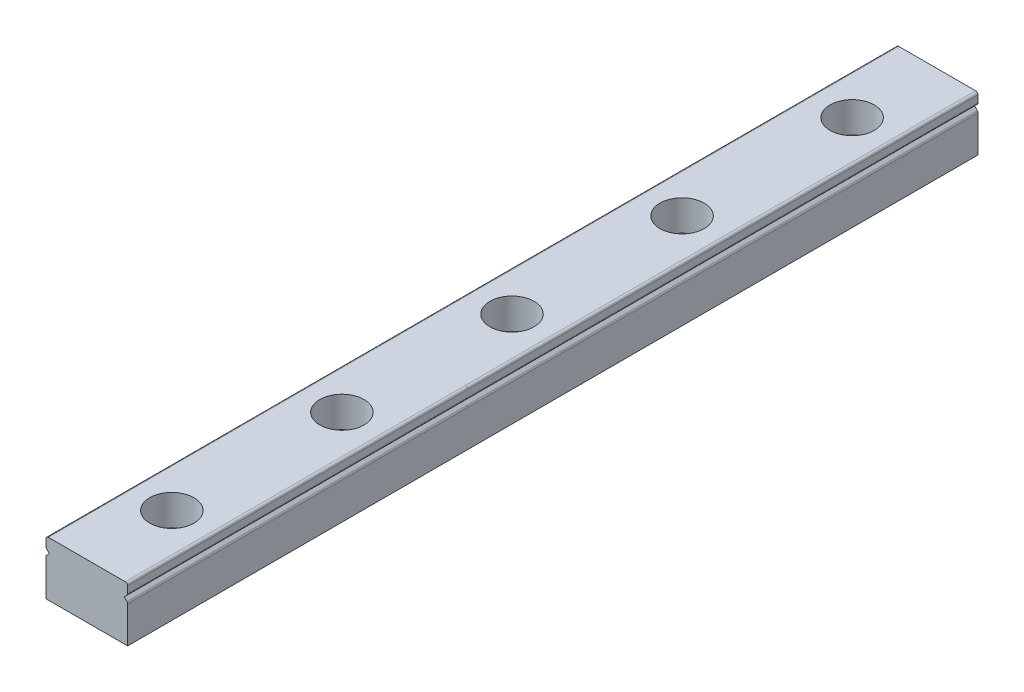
ISO-10303-21;
HEADER;
FILE_DESCRIPTION(('STEP AP214'),'2;1');
FILE_NAME('part.step','',(''),(''),'','','');
FILE_SCHEMA(('AUTOMOTIVE_DESIGN { 1 0 10303 214 1 1 1 1 }'));
ENDSEC;
DATA;
#1=APPLICATION_CONTEXT('core data for automotive mechanical design processes');
#2=APPLICATION_PROTOCOL_DEFINITION('international standard','automotive_design',2000,#1);
#3=PRODUCT_CONTEXT('',#1,'mechanical');
#4=PRODUCT('Part','Part','',(#3));
#5=PRODUCT_RELATED_PRODUCT_CATEGORY('part','',(#4));
#6=PRODUCT_DEFINITION_FORMATION('','',#4);
#7=PRODUCT_DEFINITION_CONTEXT('part definition',#1,'design');
#8=PRODUCT_DEFINITION('design','',#6,#7);
#9=PRODUCT_DEFINITION_SHAPE('','',#8);
#10=(LENGTH_UNIT() NAMED_UNIT(*) SI_UNIT(.MILLI.,.METRE.));
#11=(NAMED_UNIT(*) PLANE_ANGLE_UNIT() SI_UNIT($,.RADIAN.));
#12=(NAMED_UNIT(*) SI_UNIT($,.STERADIAN.) SOLID_ANGLE_UNIT());
#13=UNCERTAINTY_MEASURE_WITH_UNIT(LENGTH_MEASURE(1.E-05),#10,'distance_accuracy_value','');
#14=(GEOMETRIC_REPRESENTATION_CONTEXT(3) GLOBAL_UNCERTAINTY_ASSIGNED_CONTEXT((#13)) GLOBAL_UNIT_ASSIGNED_CONTEXT((#10,
#11,#12)) REPRESENTATION_CONTEXT('',''));
#15=CARTESIAN_POINT('',(0.,0.,0.));
#16=DIRECTION('',(0.,0.,1.));
#17=DIRECTION('',(1.,0.,0.));
#18=AXIS2_PLACEMENT_3D('',#15,#16,#17);
#19=CARTESIAN_POINT('',(0.,0.,75.));
#20=DIRECTION('',(0.,1.,0.));
#21=DIRECTION('',(0.,0.,1.));
#22=AXIS2_PLACEMENT_3D('',#19,#20,#21);
#23=PLANE('',#22);
#24=CARTESIAN_POINT('',(0.,0.,12.5));
#25=DIRECTION('',(0.,1.,0.));
#26=DIRECTION('',(0.,0.,1.));
#27=AXIS2_PLACEMENT_3D('',#24,#25,#26);
#28=CIRCLE('',#27,1.75);
#29=CARTESIAN_POINT('',(0.,0.,14.25));
#30=VERTEX_POINT('',#29);
#31=EDGE_CURVE('E449',#30,#30,#28,.T.);
#32=ORIENTED_EDGE('',*,*,#31,.T.);
#33=EDGE_LOOP('',(#32));
#34=FACE_BOUND('',#33,.T.);
#35=CARTESIAN_POINT('',(0.,0.,37.5));
#36=DIRECTION('',(0.,1.,0.));
#37=DIRECTION('',(0.,0.,1.));
#38=AXIS2_PLACEMENT_3D('',#35,#36,#37);
#39=CIRCLE('',#38,1.75);
#40=CARTESIAN_POINT('',(0.,0.,39.25));
#41=VERTEX_POINT('',#40);
#42=EDGE_CURVE('E437',#41,#41,#39,.T.);
#43=ORIENTED_EDGE('',*,*,#42,.T.);
#44=EDGE_LOOP('',(#43));
#45=FACE_BOUND('',#44,.T.);
#46=CARTESIAN_POINT('',(0.,0.,-12.5));
#47=DIRECTION('',(0.,1.,0.));
#48=DIRECTION('',(0.,0.,1.));
#49=AXIS2_PLACEMENT_3D('',#46,#47,#48);
#50=CIRCLE('',#49,1.75);
#51=CARTESIAN_POINT('',(0.,0.,-10.75));
#52=VERTEX_POINT('',#51);
#53=EDGE_CURVE('E407',#52,#52,#50,.T.);
#54=ORIENTED_EDGE('',*,*,#53,.T.);
#55=EDGE_LOOP('',(#54));
#56=FACE_BOUND('',#55,.T.);
#57=CARTESIAN_POINT('',(0.,0.,-37.5));
#58=DIRECTION('',(0.,1.,0.));
#59=DIRECTION('',(0.,0.,1.));
#60=AXIS2_PLACEMENT_3D('',#57,#58,#59);
#61=CIRCLE('',#60,1.75);
#62=CARTESIAN_POINT('',(0.,0.,-35.75));
#63=VERTEX_POINT('',#62);
#64=EDGE_CURVE('E395',#63,#63,#61,.T.);
#65=ORIENTED_EDGE('',*,*,#64,.T.);
#66=EDGE_LOOP('',(#65));
#67=FACE_BOUND('',#66,.T.);
#68=CARTESIAN_POINT('',(0.,0.,-62.5));
#69=DIRECTION('',(0.,1.,0.));
#70=DIRECTION('',(0.,0.,1.));
#71=AXIS2_PLACEMENT_3D('',#68,#69,#70);
#72=CIRCLE('',#71,1.75);
#73=CARTESIAN_POINT('',(0.,0.,-60.75));
#74=VERTEX_POINT('',#73);
#75=EDGE_CURVE('E203',#74,#74,#72,.T.);
#76=ORIENTED_EDGE('',*,*,#75,.T.);
#77=EDGE_LOOP('',(#76));
#78=FACE_BOUND('',#77,.T.);
#79=DIRECTION('',(-1.,0.,0.));
#80=VECTOR('',#79,1.);
#81=CARTESIAN_POINT('',(-20.7186141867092,0.,50.));
#82=LINE('',#81,#80);
#83=CARTESIAN_POINT('',(6.,0.,50.));
#84=VERTEX_POINT('',#83);
#85=CARTESIAN_POINT('',(-6.,0.,50.));
#86=VERTEX_POINT('',#85);
#87=EDGE_CURVE('E183',#84,#86,#82,.T.);
#88=ORIENTED_EDGE('',*,*,#87,.T.);
#89=DIRECTION('',(0.,0.,-1.));
#90=VECTOR('',#89,1.);
#91=CARTESIAN_POINT('',(-6.,0.,75.));
#92=LINE('',#91,#90);
#93=CARTESIAN_POINT('',(-6.,0.,-75.));
#94=VERTEX_POINT('',#93);
#95=EDGE_CURVE('E353',#86,#94,#92,.T.);
#96=ORIENTED_EDGE('',*,*,#95,.T.);
#97=DIRECTION('',(1.,0.,0.));
#98=VECTOR('',#97,1.);
#99=CARTESIAN_POINT('',(0.,0.,-75.));
#100=LINE('',#99,#98);
#101=CARTESIAN_POINT('',(6.,0.,-75.));
#102=VERTEX_POINT('',#101);
#103=EDGE_CURVE('E208',#94,#102,#100,.T.);
#104=ORIENTED_EDGE('',*,*,#103,.T.);
#105=DIRECTION('',(0.,0.,-1.));
#106=VECTOR('',#105,1.);
#107=CARTESIAN_POINT('',(6.,0.,75.));
#108=LINE('',#107,#106);
#109=EDGE_CURVE('E198',#84,#102,#108,.T.);
#110=ORIENTED_EDGE('',*,*,#109,.F.);
#111=EDGE_LOOP('',(#88,#96,#104,#110));
#112=FACE_BOUND('',#111,.T.);
#113=ADVANCED_FACE('F34',(#34,#45,#56,#67,#78,#112),#23,.F.);
#114=CARTESIAN_POINT('',(6.,0.,75.));
#115=DIRECTION('',(-1.,0.,0.));
#116=DIRECTION('',(0.,-1.,0.));
#117=AXIS2_PLACEMENT_3D('',#114,#115,#116);
#118=PLANE('',#117);
#119=DIRECTION('',(0.,1.,0.));
#120=VECTOR('',#119,1.);
#121=CARTESIAN_POINT('',(6.,0.,50.));
#122=LINE('',#121,#120);
#123=CARTESIAN_POINT('',(6.,5.35502525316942,50.));
#124=VERTEX_POINT('',#123);
#125=EDGE_CURVE('E186',#84,#124,#122,.T.);
#126=ORIENTED_EDGE('',*,*,#125,.F.);
#127=ORIENTED_EDGE('',*,*,#109,.T.);
#128=DIRECTION('',(0.,1.,0.));
#129=VECTOR('',#128,1.);
#130=CARTESIAN_POINT('',(6.,0.,-75.));
#131=LINE('',#130,#129);
#132=CARTESIAN_POINT('',(6.,5.35502525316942,-75.));
#133=VERTEX_POINT('',#132);
#134=EDGE_CURVE('E434',#102,#133,#131,.T.);
#135=ORIENTED_EDGE('',*,*,#134,.T.);
#136=DIRECTION('',(0.,0.,1.));
#137=VECTOR('',#136,1.);
#138=CARTESIAN_POINT('',(6.,5.35502525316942,75.));
#139=LINE('',#138,#137);
#140=CARTESIAN_POINT('',(6.,5.35502525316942,0.));
#141=VERTEX_POINT('',#140);
#142=EDGE_CURVE('E307',#133,#141,#139,.T.);
#143=ORIENTED_EDGE('',*,*,#142,.T.);
#144=DIRECTION('',(0.,0.,-1.));
#145=VECTOR('',#144,1.);
#146=CARTESIAN_POINT('',(6.,5.35502525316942,75.));
#147=LINE('',#146,#145);
#148=EDGE_CURVE('E202',#141,#124,#147,.F.);
#149=ORIENTED_EDGE('',*,*,#148,.T.);
#150=EDGE_LOOP('',(#126,#127,#135,#143,#149));
#151=FACE_BOUND('',#150,.T.);
#152=ADVANCED_FACE('F196',(#151),#118,.F.);
#153=CARTESIAN_POINT('',(5.5,6.,75.));
#154=DIRECTION('',(-0.707106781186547,-0.707106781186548,0.));
#155=DIRECTION('',(0.707106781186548,-0.707106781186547,0.));
#156=AXIS2_PLACEMENT_3D('',#153,#154,#155);
#157=PLANE('',#156);
#158=DIRECTION('',(-0.707106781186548,0.707106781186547,0.));
#159=VECTOR('',#158,1.);
#160=CARTESIAN_POINT('',(5.5,6.,50.));
#161=LINE('',#160,#159);
#162=CARTESIAN_POINT('',(5.89748737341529,5.60251262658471,50.));
#163=VERTEX_POINT('',#162);
#164=CARTESIAN_POINT('',(5.5,6.,50.));
#165=VERTEX_POINT('',#164);
#166=EDGE_CURVE('E381',#163,#165,#161,.T.);
#167=ORIENTED_EDGE('',*,*,#166,.F.);
#168=DIRECTION('',(0.,0.,-1.));
#169=VECTOR('',#168,1.);
#170=CARTESIAN_POINT('',(5.89748737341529,5.60251262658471,75.));
#171=LINE('',#170,#169);
#172=CARTESIAN_POINT('',(5.89748737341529,5.60251262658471,0.));
#173=VERTEX_POINT('',#172);
#174=EDGE_CURVE('E230',#163,#173,#171,.T.);
#175=ORIENTED_EDGE('',*,*,#174,.T.);
#176=DIRECTION('',(0.,0.,1.));
#177=VECTOR('',#176,1.);
#178=CARTESIAN_POINT('',(5.89748737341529,5.60251262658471,75.));
#179=LINE('',#178,#177);
#180=CARTESIAN_POINT('',(5.89748737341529,5.60251262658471,-75.));
#181=VERTEX_POINT('',#180);
#182=EDGE_CURVE('E311',#173,#181,#179,.F.);
#183=ORIENTED_EDGE('',*,*,#182,.T.);
#184=DIRECTION('',(-0.707106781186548,0.707106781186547,0.));
#185=VECTOR('',#184,1.);
#186=CARTESIAN_POINT('',(5.5,6.,-75.));
#187=LINE('',#186,#185);
#188=CARTESIAN_POINT('',(5.5,6.,-75.));
#189=VERTEX_POINT('',#188);
#190=EDGE_CURVE('E431',#181,#189,#187,.T.);
#191=ORIENTED_EDGE('',*,*,#190,.T.);
#192=DIRECTION('',(0.,0.,-1.));
#193=VECTOR('',#192,1.);
#194=CARTESIAN_POINT('',(5.5,6.,75.));
#195=LINE('',#194,#193);
#196=EDGE_CURVE('E209',#165,#189,#195,.T.);
#197=ORIENTED_EDGE('',*,*,#196,.F.);
#198=EDGE_LOOP('',(#167,#175,#183,#191,#197));
#199=FACE_BOUND('',#198,.T.);
#200=ADVANCED_FACE('F480',(#199),#157,.F.);
#201=CARTESIAN_POINT('',(6.,6.5,75.));
#202=DIRECTION('',(-0.707106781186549,0.707106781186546,0.));
#203=DIRECTION('',(-0.707106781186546,-0.707106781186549,0.));
#204=AXIS2_PLACEMENT_3D('',#201,#202,#203);
#205=PLANE('',#204);
#206=DIRECTION('',(0.707106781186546,0.707106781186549,0.));
#207=VECTOR('',#206,1.);
#208=CARTESIAN_POINT('',(6.,6.5,50.));
#209=LINE('',#208,#207);
#210=CARTESIAN_POINT('',(5.89748737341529,6.39748737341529,50.));
#211=VERTEX_POINT('',#210);
#212=EDGE_CURVE('E379',#165,#211,#209,.T.);
#213=ORIENTED_EDGE('',*,*,#212,.F.);
#214=ORIENTED_EDGE('',*,*,#196,.T.);
#215=DIRECTION('',(0.707106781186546,0.707106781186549,0.));
#216=VECTOR('',#215,1.);
#217=CARTESIAN_POINT('',(6.,6.5,-75.));
#218=LINE('',#217,#216);
#219=CARTESIAN_POINT('',(5.89748737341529,6.39748737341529,-75.));
#220=VERTEX_POINT('',#219);
#221=EDGE_CURVE('E428',#189,#220,#218,.T.);
#222=ORIENTED_EDGE('',*,*,#221,.T.);
#223=DIRECTION('',(0.,0.,1.));
#224=VECTOR('',#223,1.);
#225=CARTESIAN_POINT('',(5.89748737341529,6.39748737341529,75.));
#226=LINE('',#225,#224);
#227=CARTESIAN_POINT('',(5.89748737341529,6.39748737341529,0.));
#228=VERTEX_POINT('',#227);
#229=EDGE_CURVE('E305',#220,#228,#226,.T.);
#230=ORIENTED_EDGE('',*,*,#229,.T.);
#231=DIRECTION('',(0.,0.,-1.));
#232=VECTOR('',#231,1.);
#233=CARTESIAN_POINT('',(5.89748737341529,6.39748737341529,75.));
#234=LINE('',#233,#232);
#235=EDGE_CURVE('E231',#228,#211,#234,.F.);
#236=ORIENTED_EDGE('',*,*,#235,.T.);
#237=EDGE_LOOP('',(#213,#214,#222,#230,#236));
#238=FACE_BOUND('',#237,.T.);
#239=ADVANCED_FACE('F770',(#238),#205,.F.);
#240=CARTESIAN_POINT('',(6.,8.,75.));
#241=DIRECTION('',(-1.,0.,0.));
#242=DIRECTION('',(0.,0.,1.));
#243=AXIS2_PLACEMENT_3D('',#240,#241,#242);
#244=PLANE('',#243);
#245=DIRECTION('',(0.,1.,0.));
#246=VECTOR('',#245,1.);
#247=CARTESIAN_POINT('',(6.,8.,50.));
#248=LINE('',#247,#246);
#249=CARTESIAN_POINT('',(6.,6.64497474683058,50.));
#250=VERTEX_POINT('',#249);
#251=CARTESIAN_POINT('',(6.,7.65,50.));
#252=VERTEX_POINT('',#251);
#253=EDGE_CURVE('E374',#250,#252,#248,.T.);
#254=ORIENTED_EDGE('',*,*,#253,.F.);
#255=DIRECTION('',(0.,0.,-1.));
#256=VECTOR('',#255,1.);
#257=CARTESIAN_POINT('',(6.,6.64497474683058,75.));
#258=LINE('',#257,#256);
#259=CARTESIAN_POINT('',(6.,6.64497474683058,0.));
#260=VERTEX_POINT('',#259);
#261=EDGE_CURVE('E233',#250,#260,#258,.T.);
#262=ORIENTED_EDGE('',*,*,#261,.T.);
#263=DIRECTION('',(0.,0.,1.));
#264=VECTOR('',#263,1.);
#265=CARTESIAN_POINT('',(6.,6.64497474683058,75.));
#266=LINE('',#265,#264);
#267=CARTESIAN_POINT('',(6.,6.64497474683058,-75.));
#268=VERTEX_POINT('',#267);
#269=EDGE_CURVE('E279',#260,#268,#266,.F.);
#270=ORIENTED_EDGE('',*,*,#269,.T.);
#271=DIRECTION('',(0.,1.,0.));
#272=VECTOR('',#271,1.);
#273=CARTESIAN_POINT('',(6.,8.,-75.));
#274=LINE('',#273,#272);
#275=CARTESIAN_POINT('',(6.,7.65,-75.));
#276=VERTEX_POINT('',#275);
#277=EDGE_CURVE('E426',#268,#276,#274,.T.);
#278=ORIENTED_EDGE('',*,*,#277,.T.);
#279=DIRECTION('',(0.,0.,1.));
#280=VECTOR('',#279,1.);
#281=CARTESIAN_POINT('',(6.,7.65,75.));
#282=LINE('',#281,#280);
#283=CARTESIAN_POINT('',(6.,7.65,0.));
#284=VERTEX_POINT('',#283);
#285=EDGE_CURVE('E283',#276,#284,#282,.T.);
#286=ORIENTED_EDGE('',*,*,#285,.T.);
#287=DIRECTION('',(0.,0.,-1.));
#288=VECTOR('',#287,1.);
#289=CARTESIAN_POINT('',(6.,7.65,75.));
#290=LINE('',#289,#288);
#291=EDGE_CURVE('E235',#284,#252,#290,.F.);
#292=ORIENTED_EDGE('',*,*,#291,.T.);
#293=EDGE_LOOP('',(#254,#262,#270,#278,#286,#292));
#294=FACE_BOUND('',#293,.T.);
#295=ADVANCED_FACE('F514',(#294),#244,.F.);
#296=CARTESIAN_POINT('',(0.,8.,75.));
#297=DIRECTION('',(0.,-1.,0.));
#298=DIRECTION('',(0.,0.,-1.));
#299=AXIS2_PLACEMENT_3D('',#296,#297,#298);
#300=PLANE('',#299);
#301=CARTESIAN_POINT('',(0.,8.,12.5));
#302=DIRECTION('',(0.,1.,0.));
#303=DIRECTION('',(0.,0.,1.));
#304=AXIS2_PLACEMENT_3D('',#301,#302,#303);
#305=CIRCLE('',#304,3.25);
#306=CARTESIAN_POINT('',(0.,8.,15.75));
#307=VERTEX_POINT('',#306);
#308=EDGE_CURVE('E458',#307,#307,#305,.T.);
#309=ORIENTED_EDGE('',*,*,#308,.F.);
#310=EDGE_LOOP('',(#309));
#311=FACE_BOUND('',#310,.T.);
#312=CARTESIAN_POINT('',(0.,8.,37.5));
#313=DIRECTION('',(0.,1.,0.));
#314=DIRECTION('',(0.,0.,1.));
#315=AXIS2_PLACEMENT_3D('',#312,#313,#314);
#316=CIRCLE('',#315,3.25);
#317=CARTESIAN_POINT('',(0.,8.,40.75));
#318=VERTEX_POINT('',#317);
#319=EDGE_CURVE('E440',#318,#318,#316,.T.);
#320=ORIENTED_EDGE('',*,*,#319,.F.);
#321=EDGE_LOOP('',(#320));
#322=FACE_BOUND('',#321,.T.);
#323=CARTESIAN_POINT('',(0.,8.,-12.5));
#324=DIRECTION('',(0.,1.,0.));
#325=DIRECTION('',(0.,0.,1.));
#326=AXIS2_PLACEMENT_3D('',#323,#324,#325);
#327=CIRCLE('',#326,3.25);
#328=CARTESIAN_POINT('',(0.,8.,-9.25));
#329=VERTEX_POINT('',#328);
#330=EDGE_CURVE('E346',#329,#329,#327,.T.);
#331=ORIENTED_EDGE('',*,*,#330,.F.);
#332=EDGE_LOOP('',(#331));
#333=FACE_BOUND('',#332,.T.);
#334=CARTESIAN_POINT('',(0.,8.,-37.5));
#335=DIRECTION('',(0.,1.,0.));
#336=DIRECTION('',(0.,0.,1.));
#337=AXIS2_PLACEMENT_3D('',#334,#335,#336);
#338=CIRCLE('',#337,3.25);
#339=CARTESIAN_POINT('',(0.,8.,-34.25));
#340=VERTEX_POINT('',#339);
#341=EDGE_CURVE('E404',#340,#340,#338,.T.);
#342=ORIENTED_EDGE('',*,*,#341,.F.);
#343=EDGE_LOOP('',(#342));
#344=FACE_BOUND('',#343,.T.);
#345=CARTESIAN_POINT('',(0.,8.,-62.5));
#346=DIRECTION('',(0.,1.,0.));
#347=DIRECTION('',(0.,0.,1.));
#348=AXIS2_PLACEMENT_3D('',#345,#346,#347);
#349=CIRCLE('',#348,3.25);
#350=CARTESIAN_POINT('',(0.,8.,-59.25));
#351=VERTEX_POINT('',#350);
#352=EDGE_CURVE('E392',#351,#351,#349,.T.);
#353=ORIENTED_EDGE('',*,*,#352,.F.);
#354=EDGE_LOOP('',(#353));
#355=FACE_BOUND('',#354,.T.);
#356=DIRECTION('',(-1.,0.,0.));
#357=VECTOR('',#356,1.);
#358=CARTESIAN_POINT('',(0.,8.,50.));
#359=LINE('',#358,#357);
#360=CARTESIAN_POINT('',(5.65,8.,50.));
#361=VERTEX_POINT('',#360);
#362=CARTESIAN_POINT('',(-5.65,8.,50.));
#363=VERTEX_POINT('',#362);
#364=EDGE_CURVE('E369',#361,#363,#359,.T.);
#365=ORIENTED_EDGE('',*,*,#364,.F.);
#366=DIRECTION('',(0.,0.,-1.));
#367=VECTOR('',#366,1.);
#368=CARTESIAN_POINT('',(5.65,8.,75.));
#369=LINE('',#368,#367);
#370=CARTESIAN_POINT('',(5.65,8.,0.));
#371=VERTEX_POINT('',#370);
#372=EDGE_CURVE('E37',#361,#371,#369,.T.);
#373=ORIENTED_EDGE('',*,*,#372,.T.);
#374=DIRECTION('',(0.,0.,1.));
#375=VECTOR('',#374,1.);
#376=CARTESIAN_POINT('',(5.65,8.,75.));
#377=LINE('',#376,#375);
#378=CARTESIAN_POINT('',(5.65,8.,-75.));
#379=VERTEX_POINT('',#378);
#380=EDGE_CURVE('E288',#371,#379,#377,.F.);
#381=ORIENTED_EDGE('',*,*,#380,.T.);
#382=DIRECTION('',(-1.,0.,0.));
#383=VECTOR('',#382,1.);
#384=CARTESIAN_POINT('',(0.,8.,-75.));
#385=LINE('',#384,#383);
#386=CARTESIAN_POINT('',(-5.65,8.,-75.));
#387=VERTEX_POINT('',#386);
#388=EDGE_CURVE('E423',#379,#387,#385,.T.);
#389=ORIENTED_EDGE('',*,*,#388,.T.);
#390=DIRECTION('',(0.,0.,1.));
#391=VECTOR('',#390,1.);
#392=CARTESIAN_POINT('',(-5.65,8.,0.));
#393=LINE('',#392,#391);
#394=CARTESIAN_POINT('',(-5.65,8.,0.));
#395=VERTEX_POINT('',#394);
#396=EDGE_CURVE('E315',#387,#395,#393,.T.);
#397=ORIENTED_EDGE('',*,*,#396,.T.);
#398=DIRECTION('',(0.,0.,-1.));
#399=VECTOR('',#398,1.);
#400=CARTESIAN_POINT('',(-5.65,8.,75.));
#401=LINE('',#400,#399);
#402=EDGE_CURVE('E270',#395,#363,#401,.F.);
#403=ORIENTED_EDGE('',*,*,#402,.T.);
#404=EDGE_LOOP('',(#365,#373,#381,#389,#397,#403));
#405=FACE_BOUND('',#404,.T.);
#406=ADVANCED_FACE('F510',(#311,#322,#333,#344,#355,#405),#300,.F.);
#407=CARTESIAN_POINT('',(5.65,7.65,75.));
#408=DIRECTION('',(0.,0.,-1.));
#409=DIRECTION('',(-1.,0.,0.));
#410=AXIS2_PLACEMENT_3D('',#407,#408,#409);
#411=CYLINDRICAL_SURFACE('',#410,0.35);
#412=ORIENTED_EDGE('',*,*,#372,.F.);
#413=CARTESIAN_POINT('',(5.65,7.65,50.));
#414=DIRECTION('',(0.,0.,1.));
#415=DIRECTION('',(1.,0.,0.));
#416=AXIS2_PLACEMENT_3D('',#413,#414,#415);
#417=CIRCLE('',#416,0.35);
#418=EDGE_CURVE('E371',#361,#252,#417,.F.);
#419=ORIENTED_EDGE('',*,*,#418,.T.);
#420=ORIENTED_EDGE('',*,*,#291,.F.);
#421=CARTESIAN_POINT('',(5.65,7.65,0.));
#422=DIRECTION('',(0.,0.,1.));
#423=DIRECTION('',(1.,0.,0.));
#424=AXIS2_PLACEMENT_3D('',#421,#422,#423);
#425=CIRCLE('',#424,0.35);
#426=EDGE_CURVE('E236',#371,#284,#425,.F.);
#427=ORIENTED_EDGE('',*,*,#426,.F.);
#428=EDGE_LOOP('',(#412,#419,#420,#427));
#429=FACE_BOUND('',#428,.T.);
#430=ADVANCED_FACE('F513',(#429),#411,.T.);
#431=CARTESIAN_POINT('',(5.65,6.64497474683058,75.));
#432=DIRECTION('',(0.,0.,-1.));
#433=DIRECTION('',(-1.,0.,0.));
#434=AXIS2_PLACEMENT_3D('',#431,#432,#433);
#435=CYLINDRICAL_SURFACE('',#434,0.35);
#436=ORIENTED_EDGE('',*,*,#261,.F.);
#437=CARTESIAN_POINT('',(5.65,6.64497474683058,50.));
#438=DIRECTION('',(0.,0.,1.));
#439=DIRECTION('',(1.,0.,0.));
#440=AXIS2_PLACEMENT_3D('',#437,#438,#439);
#441=CIRCLE('',#440,0.35);
#442=EDGE_CURVE('E376',#250,#211,#441,.F.);
#443=ORIENTED_EDGE('',*,*,#442,.T.);
#444=ORIENTED_EDGE('',*,*,#235,.F.);
#445=CARTESIAN_POINT('',(5.65,6.64497474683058,0.));
#446=DIRECTION('',(0.,0.,1.));
#447=DIRECTION('',(1.,0.,0.));
#448=AXIS2_PLACEMENT_3D('',#445,#446,#447);
#449=CIRCLE('',#448,0.35);
#450=EDGE_CURVE('E223',#260,#228,#449,.F.);
#451=ORIENTED_EDGE('',*,*,#450,.F.);
#452=EDGE_LOOP('',(#436,#443,#444,#451));
#453=FACE_BOUND('',#452,.T.);
#454=ADVANCED_FACE('F806',(#453),#435,.T.);
#455=CARTESIAN_POINT('',(5.65,5.35502525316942,75.));
#456=DIRECTION('',(0.,0.,-1.));
#457=DIRECTION('',(-1.,0.,0.));
#458=AXIS2_PLACEMENT_3D('',#455,#456,#457);
#459=CYLINDRICAL_SURFACE('',#458,0.35);
#460=ORIENTED_EDGE('',*,*,#174,.F.);
#461=CARTESIAN_POINT('',(5.65,5.35502525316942,50.));
#462=DIRECTION('',(0.,0.,1.));
#463=DIRECTION('',(1.,0.,0.));
#464=AXIS2_PLACEMENT_3D('',#461,#462,#463);
#465=CIRCLE('',#464,0.35);
#466=EDGE_CURVE('E204',#163,#124,#465,.F.);
#467=ORIENTED_EDGE('',*,*,#466,.T.);
#468=ORIENTED_EDGE('',*,*,#148,.F.);
#469=CARTESIAN_POINT('',(5.65,5.35502525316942,0.));
#470=DIRECTION('',(0.,0.,1.));
#471=DIRECTION('',(1.,0.,0.));
#472=AXIS2_PLACEMENT_3D('',#469,#470,#471);
#473=CIRCLE('',#472,0.35);
#474=EDGE_CURVE('E211',#173,#141,#473,.F.);
#475=ORIENTED_EDGE('',*,*,#474,.F.);
#476=EDGE_LOOP('',(#460,#467,#468,#475));
#477=FACE_BOUND('',#476,.T.);
#478=ADVANCED_FACE('F472',(#477),#459,.T.);
#479=CARTESIAN_POINT('',(-6.,8.,75.));
#480=DIRECTION('',(-1.,0.,0.));
#481=DIRECTION('',(0.,0.,1.));
#482=AXIS2_PLACEMENT_3D('',#479,#480,#481);
#483=PLANE('',#482);
#484=DIRECTION('',(0.,0.,-1.));
#485=VECTOR('',#484,1.);
#486=CARTESIAN_POINT('',(-6.,6.64497474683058,75.));
#487=LINE('',#486,#485);
#488=CARTESIAN_POINT('',(-6.,6.64497474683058,0.));
#489=VERTEX_POINT('',#488);
#490=CARTESIAN_POINT('',(-6.,6.64497474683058,50.));
#491=VERTEX_POINT('',#490);
#492=EDGE_CURVE('E259',#489,#491,#487,.F.);
#493=ORIENTED_EDGE('',*,*,#492,.T.);
#494=DIRECTION('',(0.,1.,0.));
#495=VECTOR('',#494,1.);
#496=CARTESIAN_POINT('',(-6.,8.,50.));
#497=LINE('',#496,#495);
#498=CARTESIAN_POINT('',(-6.,7.65,50.));
#499=VERTEX_POINT('',#498);
#500=EDGE_CURVE('E363',#491,#499,#497,.T.);
#501=ORIENTED_EDGE('',*,*,#500,.T.);
#502=DIRECTION('',(0.,0.,-1.));
#503=VECTOR('',#502,1.);
#504=CARTESIAN_POINT('',(-6.,7.65,0.));
#505=LINE('',#504,#503);
#506=CARTESIAN_POINT('',(-6.,7.65,0.));
#507=VERTEX_POINT('',#506);
#508=EDGE_CURVE('E262',#499,#507,#505,.T.);
#509=ORIENTED_EDGE('',*,*,#508,.T.);
#510=DIRECTION('',(0.,0.,1.));
#511=VECTOR('',#510,1.);
#512=CARTESIAN_POINT('',(-6.,7.65,-75.));
#513=LINE('',#512,#511);
#514=CARTESIAN_POINT('',(-6.,7.65,-75.));
#515=VERTEX_POINT('',#514);
#516=EDGE_CURVE('E323',#507,#515,#513,.F.);
#517=ORIENTED_EDGE('',*,*,#516,.T.);
#518=DIRECTION('',(0.,1.,0.));
#519=VECTOR('',#518,1.);
#520=CARTESIAN_POINT('',(-6.,8.,-75.));
#521=LINE('',#520,#519);
#522=CARTESIAN_POINT('',(-6.,6.64497474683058,-75.));
#523=VERTEX_POINT('',#522);
#524=EDGE_CURVE('E421',#523,#515,#521,.T.);
#525=ORIENTED_EDGE('',*,*,#524,.F.);
#526=DIRECTION('',(0.,0.,1.));
#527=VECTOR('',#526,1.);
#528=CARTESIAN_POINT('',(-6.,6.64497474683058,75.));
#529=LINE('',#528,#527);
#530=EDGE_CURVE('E320',#523,#489,#529,.T.);
#531=ORIENTED_EDGE('',*,*,#530,.T.);
#532=EDGE_LOOP('',(#493,#501,#509,#517,#525,#531));
#533=FACE_BOUND('',#532,.T.);
#534=ADVANCED_FACE('F465',(#533),#483,.T.);
#535=CARTESIAN_POINT('',(-6.,6.5,75.));
#536=DIRECTION('',(-0.707106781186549,-0.707106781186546,0.));
#537=DIRECTION('',(0.707106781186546,-0.707106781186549,0.));
#538=AXIS2_PLACEMENT_3D('',#535,#536,#537);
#539=PLANE('',#538);
#540=DIRECTION('',(0.,0.,-1.));
#541=VECTOR('',#540,1.);
#542=CARTESIAN_POINT('',(-5.5,6.,75.));
#543=LINE('',#542,#541);
#544=CARTESIAN_POINT('',(-5.5,6.,50.));
#545=VERTEX_POINT('',#544);
#546=CARTESIAN_POINT('',(-5.5,6.,-75.));
#547=VERTEX_POINT('',#546);
#548=EDGE_CURVE('E212',#545,#547,#543,.T.);
#549=ORIENTED_EDGE('',*,*,#548,.F.);
#550=DIRECTION('',(-0.707106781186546,0.707106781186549,0.));
#551=VECTOR('',#550,1.);
#552=CARTESIAN_POINT('',(-6.,6.5,50.));
#553=LINE('',#552,#551);
#554=CARTESIAN_POINT('',(-5.89748737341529,6.39748737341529,50.));
#555=VERTEX_POINT('',#554);
#556=EDGE_CURVE('E355',#545,#555,#553,.T.);
#557=ORIENTED_EDGE('',*,*,#556,.T.);
#558=DIRECTION('',(0.,0.,-1.));
#559=VECTOR('',#558,1.);
#560=CARTESIAN_POINT('',(-5.89748737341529,6.39748737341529,75.));
#561=LINE('',#560,#559);
#562=CARTESIAN_POINT('',(-5.89748737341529,6.39748737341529,0.));
#563=VERTEX_POINT('',#562);
#564=EDGE_CURVE('E273',#555,#563,#561,.T.);
#565=ORIENTED_EDGE('',*,*,#564,.T.);
#566=DIRECTION('',(0.,0.,1.));
#567=VECTOR('',#566,1.);
#568=CARTESIAN_POINT('',(-5.89748737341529,6.39748737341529,75.));
#569=LINE('',#568,#567);
#570=CARTESIAN_POINT('',(-5.89748737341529,6.39748737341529,-75.));
#571=VERTEX_POINT('',#570);
#572=EDGE_CURVE('E58',#563,#571,#569,.F.);
#573=ORIENTED_EDGE('',*,*,#572,.T.);
#574=DIRECTION('',(-0.707106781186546,0.707106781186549,0.));
#575=VECTOR('',#574,1.);
#576=CARTESIAN_POINT('',(-6.,6.5,-75.));
#577=LINE('',#576,#575);
#578=EDGE_CURVE('E419',#547,#571,#577,.T.);
#579=ORIENTED_EDGE('',*,*,#578,.F.);
#580=EDGE_LOOP('',(#549,#557,#565,#573,#579));
#581=FACE_BOUND('',#580,.T.);
#582=ADVANCED_FACE('F463',(#581),#539,.T.);
#583=CARTESIAN_POINT('',(-5.5,6.,75.));
#584=DIRECTION('',(-0.707106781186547,0.707106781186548,0.));
#585=DIRECTION('',(-0.707106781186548,-0.707106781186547,0.));
#586=AXIS2_PLACEMENT_3D('',#583,#584,#585);
#587=PLANE('',#586);
#588=DIRECTION('',(0.,0.,-1.));
#589=VECTOR('',#588,1.);
#590=CARTESIAN_POINT('',(-5.89748737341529,5.60251262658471,75.));
#591=LINE('',#590,#589);
#592=CARTESIAN_POINT('',(-5.89748737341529,5.60251262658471,0.));
#593=VERTEX_POINT('',#592);
#594=CARTESIAN_POINT('',(-5.89748737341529,5.60251262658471,50.));
#595=VERTEX_POINT('',#594);
#596=EDGE_CURVE('E255',#593,#595,#591,.F.);
#597=ORIENTED_EDGE('',*,*,#596,.T.);
#598=DIRECTION('',(0.707106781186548,0.707106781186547,0.));
#599=VECTOR('',#598,1.);
#600=CARTESIAN_POINT('',(-5.5,6.,50.));
#601=LINE('',#600,#599);
#602=EDGE_CURVE('E51',#595,#545,#601,.T.);
#603=ORIENTED_EDGE('',*,*,#602,.T.);
#604=ORIENTED_EDGE('',*,*,#548,.T.);
#605=DIRECTION('',(0.707106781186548,0.707106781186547,0.));
#606=VECTOR('',#605,1.);
#607=CARTESIAN_POINT('',(-5.5,6.,-75.));
#608=LINE('',#607,#606);
#609=CARTESIAN_POINT('',(-5.89748737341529,5.60251262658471,-75.));
#610=VERTEX_POINT('',#609);
#611=EDGE_CURVE('E345',#610,#547,#608,.T.);
#612=ORIENTED_EDGE('',*,*,#611,.F.);
#613=DIRECTION('',(0.,0.,1.));
#614=VECTOR('',#613,1.);
#615=CARTESIAN_POINT('',(-5.89748737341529,5.60251262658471,75.));
#616=LINE('',#615,#614);
#617=EDGE_CURVE('E332',#610,#593,#616,.T.);
#618=ORIENTED_EDGE('',*,*,#617,.T.);
#619=EDGE_LOOP('',(#597,#603,#604,#612,#618));
#620=FACE_BOUND('',#619,.T.);
#621=ADVANCED_FACE('F350',(#620),#587,.T.);
#622=CARTESIAN_POINT('',(-6.,0.,75.));
#623=DIRECTION('',(-1.,0.,0.));
#624=DIRECTION('',(0.,-1.,0.));
#625=AXIS2_PLACEMENT_3D('',#622,#623,#624);
#626=PLANE('',#625);
#627=ORIENTED_EDGE('',*,*,#95,.F.);
#628=DIRECTION('',(0.,1.,0.));
#629=VECTOR('',#628,1.);
#630=CARTESIAN_POINT('',(-6.,0.,50.));
#631=LINE('',#630,#629);
#632=CARTESIAN_POINT('',(-6.,5.35502525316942,50.));
#633=VERTEX_POINT('',#632);
#634=EDGE_CURVE('E189',#86,#633,#631,.T.);
#635=ORIENTED_EDGE('',*,*,#634,.T.);
#636=DIRECTION('',(0.,0.,-1.));
#637=VECTOR('',#636,1.);
#638=CARTESIAN_POINT('',(-6.,5.35502525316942,75.));
#639=LINE('',#638,#637);
#640=CARTESIAN_POINT('',(-6.,5.35502525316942,0.));
#641=VERTEX_POINT('',#640);
#642=EDGE_CURVE('E274',#633,#641,#639,.T.);
#643=ORIENTED_EDGE('',*,*,#642,.T.);
#644=DIRECTION('',(0.,0.,1.));
#645=VECTOR('',#644,1.);
#646=CARTESIAN_POINT('',(-6.,5.35502525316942,75.));
#647=LINE('',#646,#645);
#648=CARTESIAN_POINT('',(-6.,5.35502525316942,-75.));
#649=VERTEX_POINT('',#648);
#650=EDGE_CURVE('E43',#641,#649,#647,.F.);
#651=ORIENTED_EDGE('',*,*,#650,.T.);
#652=DIRECTION('',(0.,1.,0.));
#653=VECTOR('',#652,1.);
#654=CARTESIAN_POINT('',(-6.,0.,-75.));
#655=LINE('',#654,#653);
#656=EDGE_CURVE('E337',#94,#649,#655,.T.);
#657=ORIENTED_EDGE('',*,*,#656,.F.);
#658=EDGE_LOOP('',(#627,#635,#643,#651,#657));
#659=FACE_BOUND('',#658,.T.);
#660=ADVANCED_FACE('F336',(#659),#626,.T.);
#661=CARTESIAN_POINT('',(-5.65,7.65,75.));
#662=DIRECTION('',(0.,0.,1.));
#663=DIRECTION('',(1.,0.,0.));
#664=AXIS2_PLACEMENT_3D('',#661,#662,#663);
#665=CYLINDRICAL_SURFACE('',#664,0.35);
#666=ORIENTED_EDGE('',*,*,#508,.F.);
#667=CARTESIAN_POINT('',(-5.65,7.65,50.));
#668=DIRECTION('',(0.,0.,1.));
#669=DIRECTION('',(1.,0.,0.));
#670=AXIS2_PLACEMENT_3D('',#667,#668,#669);
#671=CIRCLE('',#670,0.35);
#672=EDGE_CURVE('E366',#499,#363,#671,.F.);
#673=ORIENTED_EDGE('',*,*,#672,.T.);
#674=ORIENTED_EDGE('',*,*,#402,.F.);
#675=CARTESIAN_POINT('',(-5.65,7.65,0.));
#676=DIRECTION('',(0.,0.,1.));
#677=DIRECTION('',(1.,0.,0.));
#678=AXIS2_PLACEMENT_3D('',#675,#676,#677);
#679=CIRCLE('',#678,0.35);
#680=EDGE_CURVE('E268',#507,#395,#679,.F.);
#681=ORIENTED_EDGE('',*,*,#680,.F.);
#682=EDGE_LOOP('',(#666,#673,#674,#681));
#683=FACE_BOUND('',#682,.T.);
#684=ADVANCED_FACE('F537',(#683),#665,.T.);
#685=CARTESIAN_POINT('',(-5.65,6.64497474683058,75.));
#686=DIRECTION('',(0.,0.,-1.));
#687=DIRECTION('',(-1.,0.,0.));
#688=AXIS2_PLACEMENT_3D('',#685,#686,#687);
#689=CYLINDRICAL_SURFACE('',#688,0.35);
#690=ORIENTED_EDGE('',*,*,#564,.F.);
#691=CARTESIAN_POINT('',(-5.65,6.64497474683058,50.));
#692=DIRECTION('',(0.,0.,1.));
#693=DIRECTION('',(1.,0.,0.));
#694=AXIS2_PLACEMENT_3D('',#691,#692,#693);
#695=CIRCLE('',#694,0.35);
#696=EDGE_CURVE('E360',#555,#491,#695,.F.);
#697=ORIENTED_EDGE('',*,*,#696,.T.);
#698=ORIENTED_EDGE('',*,*,#492,.F.);
#699=CARTESIAN_POINT('',(-5.65,6.64497474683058,0.));
#700=DIRECTION('',(0.,0.,1.));
#701=DIRECTION('',(1.,0.,0.));
#702=AXIS2_PLACEMENT_3D('',#699,#700,#701);
#703=CIRCLE('',#702,0.35);
#704=EDGE_CURVE('E266',#563,#489,#703,.F.);
#705=ORIENTED_EDGE('',*,*,#704,.F.);
#706=EDGE_LOOP('',(#690,#697,#698,#705));
#707=FACE_BOUND('',#706,.T.);
#708=ADVANCED_FACE('F543',(#707),#689,.T.);
#709=CARTESIAN_POINT('',(-5.65,5.35502525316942,75.));
#710=DIRECTION('',(0.,0.,-1.));
#711=DIRECTION('',(-1.,0.,0.));
#712=AXIS2_PLACEMENT_3D('',#709,#710,#711);
#713=CYLINDRICAL_SURFACE('',#712,0.35);
#714=ORIENTED_EDGE('',*,*,#642,.F.);
#715=CARTESIAN_POINT('',(-5.65,5.35502525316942,50.));
#716=DIRECTION('',(0.,0.,1.));
#717=DIRECTION('',(1.,0.,0.));
#718=AXIS2_PLACEMENT_3D('',#715,#716,#717);
#719=CIRCLE('',#718,0.35);
#720=EDGE_CURVE('E11',#633,#595,#719,.F.);
#721=ORIENTED_EDGE('',*,*,#720,.T.);
#722=ORIENTED_EDGE('',*,*,#596,.F.);
#723=CARTESIAN_POINT('',(-5.65,5.35502525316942,0.));
#724=DIRECTION('',(0.,0.,1.));
#725=DIRECTION('',(1.,0.,0.));
#726=AXIS2_PLACEMENT_3D('',#723,#724,#725);
#727=CIRCLE('',#726,0.35);
#728=EDGE_CURVE('E264',#641,#593,#727,.F.);
#729=ORIENTED_EDGE('',*,*,#728,.F.);
#730=EDGE_LOOP('',(#714,#721,#722,#729));
#731=FACE_BOUND('',#730,.T.);
#732=ADVANCED_FACE('F352',(#731),#713,.T.);
#733=CARTESIAN_POINT('',(0.,8.,12.5));
#734=DIRECTION('',(0.,1.,0.));
#735=DIRECTION('',(0.,0.,1.));
#736=AXIS2_PLACEMENT_3D('',#733,#734,#735);
#737=CYLINDRICAL_SURFACE('',#736,3.25);
#738=CARTESIAN_POINT('',(0.,3.5,12.5));
#739=DIRECTION('',(0.,1.,0.));
#740=DIRECTION('',(0.,0.,1.));
#741=AXIS2_PLACEMENT_3D('',#738,#739,#740);
#742=CIRCLE('',#741,3.25);
#743=CARTESIAN_POINT('',(0.,3.5,15.75));
#744=VERTEX_POINT('',#743);
#745=EDGE_CURVE('E455',#744,#744,#742,.T.);
#746=ORIENTED_EDGE('',*,*,#745,.F.);
#747=EDGE_LOOP('',(#746));
#748=FACE_BOUND('',#747,.T.);
#749=ORIENTED_EDGE('',*,*,#308,.T.);
#750=EDGE_LOOP('',(#749));
#751=FACE_BOUND('',#750,.T.);
#752=ADVANCED_FACE('F588',(#748,#751),#737,.F.);
#753=CARTESIAN_POINT('',(1.75,3.5,12.5));
#754=DIRECTION('',(0.,-1.,0.));
#755=DIRECTION('',(0.,0.,-1.));
#756=AXIS2_PLACEMENT_3D('',#753,#754,#755);
#757=PLANE('',#756);
#758=CARTESIAN_POINT('',(0.,3.5,12.5));
#759=DIRECTION('',(0.,1.,0.));
#760=DIRECTION('',(0.,0.,1.));
#761=AXIS2_PLACEMENT_3D('',#758,#759,#760);
#762=CIRCLE('',#761,1.75);
#763=CARTESIAN_POINT('',(0.,3.5,14.25));
#764=VERTEX_POINT('',#763);
#765=EDGE_CURVE('E452',#764,#764,#762,.T.);
#766=ORIENTED_EDGE('',*,*,#765,.F.);
#767=EDGE_LOOP('',(#766));
#768=FACE_BOUND('',#767,.T.);
#769=ORIENTED_EDGE('',*,*,#745,.T.);
#770=EDGE_LOOP('',(#769));
#771=FACE_BOUND('',#770,.T.);
#772=ADVANCED_FACE('F584',(#768,#771),#757,.F.);
#773=CARTESIAN_POINT('',(0.,8.,12.5));
#774=DIRECTION('',(0.,1.,0.));
#775=DIRECTION('',(0.,0.,1.));
#776=AXIS2_PLACEMENT_3D('',#773,#774,#775);
#777=CYLINDRICAL_SURFACE('',#776,1.75);
#778=ORIENTED_EDGE('',*,*,#31,.F.);
#779=EDGE_LOOP('',(#778));
#780=FACE_BOUND('',#779,.T.);
#781=ORIENTED_EDGE('',*,*,#765,.T.);
#782=EDGE_LOOP('',(#781));
#783=FACE_BOUND('',#782,.T.);
#784=ADVANCED_FACE('F575',(#780,#783),#777,.F.);
#785=CARTESIAN_POINT('',(0.,8.,37.5));
#786=DIRECTION('',(0.,1.,0.));
#787=DIRECTION('',(0.,0.,1.));
#788=AXIS2_PLACEMENT_3D('',#785,#786,#787);
#789=CYLINDRICAL_SURFACE('',#788,3.25);
#790=CARTESIAN_POINT('',(0.,3.5,37.5));
#791=DIRECTION('',(0.,1.,0.));
#792=DIRECTION('',(0.,0.,1.));
#793=AXIS2_PLACEMENT_3D('',#790,#791,#792);
#794=CIRCLE('',#793,3.25);
#795=CARTESIAN_POINT('',(0.,3.5,40.75));
#796=VERTEX_POINT('',#795);
#797=EDGE_CURVE('E446',#796,#796,#794,.T.);
#798=ORIENTED_EDGE('',*,*,#797,.F.);
#799=EDGE_LOOP('',(#798));
#800=FACE_BOUND('',#799,.T.);
#801=ORIENTED_EDGE('',*,*,#319,.T.);
#802=EDGE_LOOP('',(#801));
#803=FACE_BOUND('',#802,.T.);
#804=ADVANCED_FACE('F570',(#800,#803),#789,.F.);
#805=CARTESIAN_POINT('',(1.75,3.5,37.5));
#806=DIRECTION('',(0.,-1.,0.));
#807=DIRECTION('',(0.,0.,-1.));
#808=AXIS2_PLACEMENT_3D('',#805,#806,#807);
#809=PLANE('',#808);
#810=CARTESIAN_POINT('',(0.,3.5,37.5));
#811=DIRECTION('',(0.,1.,0.));
#812=DIRECTION('',(0.,0.,1.));
#813=AXIS2_PLACEMENT_3D('',#810,#811,#812);
#814=CIRCLE('',#813,1.75);
#815=CARTESIAN_POINT('',(0.,3.5,39.25));
#816=VERTEX_POINT('',#815);
#817=EDGE_CURVE('E443',#816,#816,#814,.T.);
#818=ORIENTED_EDGE('',*,*,#817,.F.);
#819=EDGE_LOOP('',(#818));
#820=FACE_BOUND('',#819,.T.);
#821=ORIENTED_EDGE('',*,*,#797,.T.);
#822=EDGE_LOOP('',(#821));
#823=FACE_BOUND('',#822,.T.);
#824=ADVANCED_FACE('F573',(#820,#823),#809,.F.);
#825=CARTESIAN_POINT('',(0.,8.,37.5));
#826=DIRECTION('',(0.,1.,0.));
#827=DIRECTION('',(0.,0.,1.));
#828=AXIS2_PLACEMENT_3D('',#825,#826,#827);
#829=CYLINDRICAL_SURFACE('',#828,1.75);
#830=ORIENTED_EDGE('',*,*,#42,.F.);
#831=EDGE_LOOP('',(#830));
#832=FACE_BOUND('',#831,.T.);
#833=ORIENTED_EDGE('',*,*,#817,.T.);
#834=EDGE_LOOP('',(#833));
#835=FACE_BOUND('',#834,.T.);
#836=ADVANCED_FACE('F569',(#832,#835),#829,.F.);
#837=CARTESIAN_POINT('',(0.,0.,-75.));
#838=DIRECTION('',(0.,0.,-1.));
#839=DIRECTION('',(1.,0.,0.));
#840=AXIS2_PLACEMENT_3D('',#837,#838,#839);
#841=PLANE('',#840);
#842=ORIENTED_EDGE('',*,*,#524,.T.);
#843=CARTESIAN_POINT('',(-5.65,7.65,-75.));
#844=DIRECTION('',(0.,0.,-1.));
#845=DIRECTION('',(-1.,0.,0.));
#846=AXIS2_PLACEMENT_3D('',#843,#844,#845);
#847=CIRCLE('',#846,0.35);
#848=EDGE_CURVE('E329',#515,#387,#847,.T.);
#849=ORIENTED_EDGE('',*,*,#848,.T.);
#850=ORIENTED_EDGE('',*,*,#388,.F.);
#851=CARTESIAN_POINT('',(5.65,7.65,-75.));
#852=DIRECTION('',(0.,0.,-1.));
#853=DIRECTION('',(-1.,0.,0.));
#854=AXIS2_PLACEMENT_3D('',#851,#852,#853);
#855=CIRCLE('',#854,0.35);
#856=EDGE_CURVE('E303',#379,#276,#855,.T.);
#857=ORIENTED_EDGE('',*,*,#856,.T.);
#858=ORIENTED_EDGE('',*,*,#277,.F.);
#859=CARTESIAN_POINT('',(5.65,6.64497474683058,-75.));
#860=DIRECTION('',(0.,0.,-1.));
#861=DIRECTION('',(-1.,0.,0.));
#862=AXIS2_PLACEMENT_3D('',#859,#860,#861);
#863=CIRCLE('',#862,0.35);
#864=EDGE_CURVE('E301',#268,#220,#863,.T.);
#865=ORIENTED_EDGE('',*,*,#864,.T.);
#866=ORIENTED_EDGE('',*,*,#221,.F.);
#867=ORIENTED_EDGE('',*,*,#190,.F.);
#868=CARTESIAN_POINT('',(5.65,5.35502525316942,-75.));
#869=DIRECTION('',(0.,0.,-1.));
#870=DIRECTION('',(-1.,0.,0.));
#871=AXIS2_PLACEMENT_3D('',#868,#869,#870);
#872=CIRCLE('',#871,0.35);
#873=EDGE_CURVE('E297',#181,#133,#872,.T.);
#874=ORIENTED_EDGE('',*,*,#873,.T.);
#875=ORIENTED_EDGE('',*,*,#134,.F.);
#876=ORIENTED_EDGE('',*,*,#103,.F.);
#877=ORIENTED_EDGE('',*,*,#656,.T.);
#878=CARTESIAN_POINT('',(-5.65,5.35502525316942,-75.));
#879=DIRECTION('',(0.,0.,-1.));
#880=DIRECTION('',(-1.,0.,0.));
#881=AXIS2_PLACEMENT_3D('',#878,#879,#880);
#882=CIRCLE('',#881,0.35);
#883=EDGE_CURVE('E325',#649,#610,#882,.T.);
#884=ORIENTED_EDGE('',*,*,#883,.T.);
#885=ORIENTED_EDGE('',*,*,#611,.T.);
#886=ORIENTED_EDGE('',*,*,#578,.T.);
#887=CARTESIAN_POINT('',(-5.65,6.64497474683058,-75.));
#888=DIRECTION('',(0.,0.,-1.));
#889=DIRECTION('',(-1.,0.,0.));
#890=AXIS2_PLACEMENT_3D('',#887,#888,#889);
#891=CIRCLE('',#890,0.35);
#892=EDGE_CURVE('E327',#571,#523,#891,.T.);
#893=ORIENTED_EDGE('',*,*,#892,.T.);
#894=EDGE_LOOP('',(#842,#849,#850,#857,#858,#865,#866,#867,#874,#875,#876,#877,#884,#885,#886,#893));
#895=FACE_BOUND('',#894,.T.);
#896=ADVANCED_FACE('F342',(#895),#841,.T.);
#897=CARTESIAN_POINT('',(5.65,7.65,75.));
#898=DIRECTION('',(0.,0.,1.));
#899=DIRECTION('',(1.,0.,0.));
#900=AXIS2_PLACEMENT_3D('',#897,#898,#899);
#901=CYLINDRICAL_SURFACE('',#900,0.35);
#902=ORIENTED_EDGE('',*,*,#856,.F.);
#903=ORIENTED_EDGE('',*,*,#380,.F.);
#904=ORIENTED_EDGE('',*,*,#426,.T.);
#905=ORIENTED_EDGE('',*,*,#285,.F.);
#906=EDGE_LOOP('',(#902,#903,#904,#905));
#907=FACE_BOUND('',#906,.T.);
#908=ADVANCED_FACE('F526',(#907),#901,.T.);
#909=CARTESIAN_POINT('',(5.65,6.64497474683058,75.));
#910=DIRECTION('',(0.,0.,1.));
#911=DIRECTION('',(1.,0.,0.));
#912=AXIS2_PLACEMENT_3D('',#909,#910,#911);
#913=CYLINDRICAL_SURFACE('',#912,0.35);
#914=ORIENTED_EDGE('',*,*,#864,.F.);
#915=ORIENTED_EDGE('',*,*,#269,.F.);
#916=ORIENTED_EDGE('',*,*,#450,.T.);
#917=ORIENTED_EDGE('',*,*,#229,.F.);
#918=EDGE_LOOP('',(#914,#915,#916,#917));
#919=FACE_BOUND('',#918,.T.);
#920=ADVANCED_FACE('F560',(#919),#913,.T.);
#921=CARTESIAN_POINT('',(5.65,5.35502525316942,75.));
#922=DIRECTION('',(0.,0.,1.));
#923=DIRECTION('',(1.,0.,0.));
#924=AXIS2_PLACEMENT_3D('',#921,#922,#923);
#925=CYLINDRICAL_SURFACE('',#924,0.35);
#926=ORIENTED_EDGE('',*,*,#873,.F.);
#927=ORIENTED_EDGE('',*,*,#182,.F.);
#928=ORIENTED_EDGE('',*,*,#474,.T.);
#929=ORIENTED_EDGE('',*,*,#142,.F.);
#930=EDGE_LOOP('',(#926,#927,#928,#929));
#931=FACE_BOUND('',#930,.T.);
#932=ADVANCED_FACE('F554',(#931),#925,.T.);
#933=CARTESIAN_POINT('',(-5.65,7.65,75.));
#934=DIRECTION('',(0.,0.,-1.));
#935=DIRECTION('',(-1.,0.,0.));
#936=AXIS2_PLACEMENT_3D('',#933,#934,#935);
#937=CYLINDRICAL_SURFACE('',#936,0.35);
#938=ORIENTED_EDGE('',*,*,#848,.F.);
#939=ORIENTED_EDGE('',*,*,#516,.F.);
#940=ORIENTED_EDGE('',*,*,#680,.T.);
#941=ORIENTED_EDGE('',*,*,#396,.F.);
#942=EDGE_LOOP('',(#938,#939,#940,#941));
#943=FACE_BOUND('',#942,.T.);
#944=ADVANCED_FACE('F533',(#943),#937,.T.);
#945=CARTESIAN_POINT('',(-5.65,6.64497474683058,75.));
#946=DIRECTION('',(0.,0.,1.));
#947=DIRECTION('',(1.,0.,0.));
#948=AXIS2_PLACEMENT_3D('',#945,#946,#947);
#949=CYLINDRICAL_SURFACE('',#948,0.35);
#950=ORIENTED_EDGE('',*,*,#892,.F.);
#951=ORIENTED_EDGE('',*,*,#572,.F.);
#952=ORIENTED_EDGE('',*,*,#704,.T.);
#953=ORIENTED_EDGE('',*,*,#530,.F.);
#954=EDGE_LOOP('',(#950,#951,#952,#953));
#955=FACE_BOUND('',#954,.T.);
#956=ADVANCED_FACE('F545',(#955),#949,.T.);
#957=CARTESIAN_POINT('',(-5.65,5.35502525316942,75.));
#958=DIRECTION('',(0.,0.,1.));
#959=DIRECTION('',(1.,0.,0.));
#960=AXIS2_PLACEMENT_3D('',#957,#958,#959);
#961=CYLINDRICAL_SURFACE('',#960,0.35);
#962=ORIENTED_EDGE('',*,*,#883,.F.);
#963=ORIENTED_EDGE('',*,*,#650,.F.);
#964=ORIENTED_EDGE('',*,*,#728,.T.);
#965=ORIENTED_EDGE('',*,*,#617,.F.);
#966=EDGE_LOOP('',(#962,#963,#964,#965));
#967=FACE_BOUND('',#966,.T.);
#968=ADVANCED_FACE('F349',(#967),#961,.T.);
#969=CARTESIAN_POINT('',(0.,8.,-12.5));
#970=DIRECTION('',(0.,1.,0.));
#971=DIRECTION('',(0.,0.,1.));
#972=AXIS2_PLACEMENT_3D('',#969,#970,#971);
#973=CYLINDRICAL_SURFACE('',#972,3.25);
#974=CARTESIAN_POINT('',(0.,3.5,-12.5));
#975=DIRECTION('',(0.,1.,0.));
#976=DIRECTION('',(0.,0.,1.));
#977=AXIS2_PLACEMENT_3D('',#974,#975,#976);
#978=CIRCLE('',#977,3.25);
#979=CARTESIAN_POINT('',(0.,3.5,-9.25));
#980=VERTEX_POINT('',#979);
#981=EDGE_CURVE('E413',#980,#980,#978,.T.);
#982=ORIENTED_EDGE('',*,*,#981,.F.);
#983=EDGE_LOOP('',(#982));
#984=FACE_BOUND('',#983,.T.);
#985=ORIENTED_EDGE('',*,*,#330,.T.);
#986=EDGE_LOOP('',(#985));
#987=FACE_BOUND('',#986,.T.);
#988=ADVANCED_FACE('F552',(#984,#987),#973,.F.);
#989=CARTESIAN_POINT('',(1.75,3.5,-12.5));
#990=DIRECTION('',(0.,-1.,0.));
#991=DIRECTION('',(0.,0.,-1.));
#992=AXIS2_PLACEMENT_3D('',#989,#990,#991);
#993=PLANE('',#992);
#994=CARTESIAN_POINT('',(0.,3.5,-12.5));
#995=DIRECTION('',(0.,1.,0.));
#996=DIRECTION('',(0.,0.,1.));
#997=AXIS2_PLACEMENT_3D('',#994,#995,#996);
#998=CIRCLE('',#997,1.75);
#999=CARTESIAN_POINT('',(0.,3.5,-10.75));
#1000=VERTEX_POINT('',#999);
#1001=EDGE_CURVE('E410',#1000,#1000,#998,.T.);
#1002=ORIENTED_EDGE('',*,*,#1001,.F.);
#1003=EDGE_LOOP('',(#1002));
#1004=FACE_BOUND('',#1003,.T.);
#1005=ORIENTED_EDGE('',*,*,#981,.T.);
#1006=EDGE_LOOP('',(#1005));
#1007=FACE_BOUND('',#1006,.T.);
#1008=ADVANCED_FACE('F680',(#1004,#1007),#993,.F.);
#1009=CARTESIAN_POINT('',(0.,8.,-12.5));
#1010=DIRECTION('',(0.,1.,0.));
#1011=DIRECTION('',(0.,0.,1.));
#1012=AXIS2_PLACEMENT_3D('',#1009,#1010,#1011);
#1013=CYLINDRICAL_SURFACE('',#1012,1.75);
#1014=ORIENTED_EDGE('',*,*,#53,.F.);
#1015=EDGE_LOOP('',(#1014));
#1016=FACE_BOUND('',#1015,.T.);
#1017=ORIENTED_EDGE('',*,*,#1001,.T.);
#1018=EDGE_LOOP('',(#1017));
#1019=FACE_BOUND('',#1018,.T.);
#1020=ADVANCED_FACE('F689',(#1016,#1019),#1013,.F.);
#1021=CARTESIAN_POINT('',(0.,8.,-37.5));
#1022=DIRECTION('',(0.,1.,0.));
#1023=DIRECTION('',(0.,0.,1.));
#1024=AXIS2_PLACEMENT_3D('',#1021,#1022,#1023);
#1025=CYLINDRICAL_SURFACE('',#1024,3.25);
#1026=CARTESIAN_POINT('',(0.,3.5,-37.5));
#1027=DIRECTION('',(0.,1.,0.));
#1028=DIRECTION('',(0.,0.,1.));
#1029=AXIS2_PLACEMENT_3D('',#1026,#1027,#1028);
#1030=CIRCLE('',#1029,3.25);
#1031=CARTESIAN_POINT('',(0.,3.5,-34.25));
#1032=VERTEX_POINT('',#1031);
#1033=EDGE_CURVE('E401',#1032,#1032,#1030,.T.);
#1034=ORIENTED_EDGE('',*,*,#1033,.F.);
#1035=EDGE_LOOP('',(#1034));
#1036=FACE_BOUND('',#1035,.T.);
#1037=ORIENTED_EDGE('',*,*,#341,.T.);
#1038=EDGE_LOOP('',(#1037));
#1039=FACE_BOUND('',#1038,.T.);
#1040=ADVANCED_FACE('F699',(#1036,#1039),#1025,.F.);
#1041=CARTESIAN_POINT('',(1.75,3.5,-37.5));
#1042=DIRECTION('',(0.,-1.,0.));
#1043=DIRECTION('',(0.,0.,-1.));
#1044=AXIS2_PLACEMENT_3D('',#1041,#1042,#1043);
#1045=PLANE('',#1044);
#1046=CARTESIAN_POINT('',(0.,3.5,-37.5));
#1047=DIRECTION('',(0.,1.,0.));
#1048=DIRECTION('',(0.,0.,1.));
#1049=AXIS2_PLACEMENT_3D('',#1046,#1047,#1048);
#1050=CIRCLE('',#1049,1.75);
#1051=CARTESIAN_POINT('',(0.,3.5,-35.75));
#1052=VERTEX_POINT('',#1051);
#1053=EDGE_CURVE('E398',#1052,#1052,#1050,.T.);
#1054=ORIENTED_EDGE('',*,*,#1053,.F.);
#1055=EDGE_LOOP('',(#1054));
#1056=FACE_BOUND('',#1055,.T.);
#1057=ORIENTED_EDGE('',*,*,#1033,.T.);
#1058=EDGE_LOOP('',(#1057));
#1059=FACE_BOUND('',#1058,.T.);
#1060=ADVANCED_FACE('F709',(#1056,#1059),#1045,.F.);
#1061=CARTESIAN_POINT('',(0.,8.,-37.5));
#1062=DIRECTION('',(0.,1.,0.));
#1063=DIRECTION('',(0.,0.,1.));
#1064=AXIS2_PLACEMENT_3D('',#1061,#1062,#1063);
#1065=CYLINDRICAL_SURFACE('',#1064,1.75);
#1066=ORIENTED_EDGE('',*,*,#64,.F.);
#1067=EDGE_LOOP('',(#1066));
#1068=FACE_BOUND('',#1067,.T.);
#1069=ORIENTED_EDGE('',*,*,#1053,.T.);
#1070=EDGE_LOOP('',(#1069));
#1071=FACE_BOUND('',#1070,.T.);
#1072=ADVANCED_FACE('F506',(#1068,#1071),#1065,.F.);
#1073=CARTESIAN_POINT('',(0.,8.,-62.5));
#1074=DIRECTION('',(0.,1.,0.));
#1075=DIRECTION('',(0.,0.,1.));
#1076=AXIS2_PLACEMENT_3D('',#1073,#1074,#1075);
#1077=CYLINDRICAL_SURFACE('',#1076,3.25);
#1078=CARTESIAN_POINT('',(0.,3.5,-62.5));
#1079=DIRECTION('',(0.,1.,0.));
#1080=DIRECTION('',(0.,0.,1.));
#1081=AXIS2_PLACEMENT_3D('',#1078,#1079,#1080);
#1082=CIRCLE('',#1081,3.25);
#1083=CARTESIAN_POINT('',(0.,3.5,-59.25));
#1084=VERTEX_POINT('',#1083);
#1085=EDGE_CURVE('E389',#1084,#1084,#1082,.T.);
#1086=ORIENTED_EDGE('',*,*,#1085,.F.);
#1087=EDGE_LOOP('',(#1086));
#1088=FACE_BOUND('',#1087,.T.);
#1089=ORIENTED_EDGE('',*,*,#352,.T.);
#1090=EDGE_LOOP('',(#1089));
#1091=FACE_BOUND('',#1090,.T.);
#1092=ADVANCED_FACE('F500',(#1088,#1091),#1077,.F.);
#1093=CARTESIAN_POINT('',(1.75,3.5,-62.5));
#1094=DIRECTION('',(0.,-1.,0.));
#1095=DIRECTION('',(0.,0.,-1.));
#1096=AXIS2_PLACEMENT_3D('',#1093,#1094,#1095);
#1097=PLANE('',#1096);
#1098=CARTESIAN_POINT('',(0.,3.5,-62.5));
#1099=DIRECTION('',(0.,1.,0.));
#1100=DIRECTION('',(0.,0.,1.));
#1101=AXIS2_PLACEMENT_3D('',#1098,#1099,#1100);
#1102=CIRCLE('',#1101,1.75);
#1103=CARTESIAN_POINT('',(0.,3.5,-60.75));
#1104=VERTEX_POINT('',#1103);
#1105=EDGE_CURVE('E386',#1104,#1104,#1102,.T.);
#1106=ORIENTED_EDGE('',*,*,#1105,.F.);
#1107=EDGE_LOOP('',(#1106));
#1108=FACE_BOUND('',#1107,.T.);
#1109=ORIENTED_EDGE('',*,*,#1085,.T.);
#1110=EDGE_LOOP('',(#1109));
#1111=FACE_BOUND('',#1110,.T.);
#1112=ADVANCED_FACE('F494',(#1108,#1111),#1097,.F.);
#1113=CARTESIAN_POINT('',(0.,8.,-62.5));
#1114=DIRECTION('',(0.,1.,0.));
#1115=DIRECTION('',(0.,0.,1.));
#1116=AXIS2_PLACEMENT_3D('',#1113,#1114,#1115);
#1117=CYLINDRICAL_SURFACE('',#1116,1.75);
#1118=ORIENTED_EDGE('',*,*,#75,.F.);
#1119=EDGE_LOOP('',(#1118));
#1120=FACE_BOUND('',#1119,.T.);
#1121=ORIENTED_EDGE('',*,*,#1105,.T.);
#1122=EDGE_LOOP('',(#1121));
#1123=FACE_BOUND('',#1122,.T.);
#1124=ADVANCED_FACE('F491',(#1120,#1123),#1117,.F.);
#1125=CARTESIAN_POINT('',(-20.7186141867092,8.00005,50.));
#1126=DIRECTION('',(0.,0.,1.));
#1127=DIRECTION('',(1.,0.,0.));
#1128=AXIS2_PLACEMENT_3D('',#1125,#1126,#1127);
#1129=PLANE('',#1128);
#1130=ORIENTED_EDGE('',*,*,#125,.T.);
#1131=ORIENTED_EDGE('',*,*,#466,.F.);
#1132=ORIENTED_EDGE('',*,*,#166,.T.);
#1133=ORIENTED_EDGE('',*,*,#212,.T.);
#1134=ORIENTED_EDGE('',*,*,#442,.F.);
#1135=ORIENTED_EDGE('',*,*,#253,.T.);
#1136=ORIENTED_EDGE('',*,*,#418,.F.);
#1137=ORIENTED_EDGE('',*,*,#364,.T.);
#1138=ORIENTED_EDGE('',*,*,#672,.F.);
#1139=ORIENTED_EDGE('',*,*,#500,.F.);
#1140=ORIENTED_EDGE('',*,*,#696,.F.);
#1141=ORIENTED_EDGE('',*,*,#556,.F.);
#1142=ORIENTED_EDGE('',*,*,#602,.F.);
#1143=ORIENTED_EDGE('',*,*,#720,.F.);
#1144=ORIENTED_EDGE('',*,*,#634,.F.);
#1145=ORIENTED_EDGE('',*,*,#87,.F.);
#1146=EDGE_LOOP('',(#1130,#1131,#1132,#1133,#1134,#1135,#1136,#1137,#1138,#1139,#1140,#1141,
#1142,#1143,#1144,#1145));
#1147=FACE_BOUND('',#1146,.T.);
#1148=ADVANCED_FACE('F185',(#1147),#1129,.T.);
#1149=CLOSED_SHELL('',(#113,#152,#200,#239,#295,#406,#430,#454,#478,#534,#582,#621,#660,#684,
#708,#732,#752,#772,#784,#804,#824,#836,#896,#908,#920,#932,#944,#956,#968,#988,#1008,#1020,
#1040,#1060,#1072,#1092,#1112,#1124,#1148));
#1150=MANIFOLD_SOLID_BREP('B2',#1149);
#1151=ADVANCED_BREP_SHAPE_REPRESENTATION('',(#18,#1150),#14);
#1152=SHAPE_DEFINITION_REPRESENTATION(#9,#1151);
ENDSEC;
END-ISO-10303-21;
